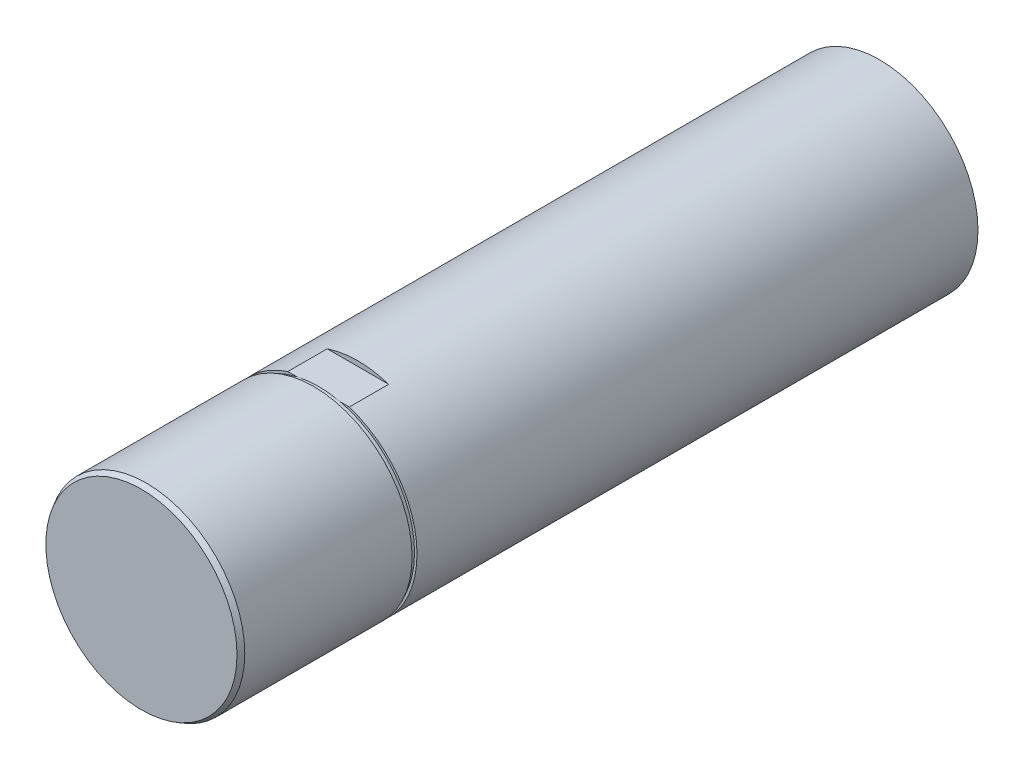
from build123d import *

# Parameters (mm, degrees)
SKETCH1_R        = 20
STROKE_DEPTH     = 100
EXTRUDE_START    = 14
SKETCH2_R        = 20
EXTRUDE_L2_DEPTH = 14
EXTRUDE_START_2  = 36
SKETCH3_R        = 20
EXTRUDE_L3_DEPTH = 36
CHAMFER2_SIZE    = 1
CHAMFER2_SIZE2   = 0.577350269
U_C_START        = 1
SKETCH5_R        = 20
SKETCH5_R_2      = 19.5
U_C_DEPTH        = 1
SKETCH6_W        = 8
SKETCH6_H        = 1.5
A_F_DEPTH        = 10.5


with BuildPart() as part:
    # Sketch1 → STROKE (new body)
    with BuildSketch(Plane.XY):
        Circle(SKETCH1_R)
    extrude(amount=-STROKE_DEPTH)

    # Sketch2 → Extrude L2 (add)
    with BuildSketch(Plane.XY.offset(EXTRUDE_START)):
        Circle(SKETCH2_R)
    extrude(amount=-EXTRUDE_L2_DEPTH)

    # Sketch3 → Extrude L3 (add)
    with BuildSketch(Plane.XY.offset(14).offset(EXTRUDE_START_2)):
        Circle(SKETCH3_R)
    extrude(amount=-EXTRUDE_L3_DEPTH)

    # Chamfer2
    chamfer2_edges = [part.edges().sort_by_distance(p)[0] for p in [
        (-20, 0, 50),
    ]]
    chamfer2_side = [part.faces().sort_by_distance(p)[0] for p in [
        (-20, 0, -25),
    ]]
    chamfer(chamfer2_edges, length=CHAMFER2_SIZE, length2=CHAMFER2_SIZE2, reference=chamfer2_side[0])

    # Sketch5 → U_C (cut)
    with BuildSketch(Plane.XY.offset(14).offset(U_C_START)):
        Circle(SKETCH5_R)
        Circle(SKETCH5_R_2, mode=Mode.SUBTRACT)
    extrude(amount=-U_C_DEPTH, mode=Mode.SUBTRACT)

    # Sketch6 → A_F (cut, symmetric)
    with BuildSketch(Plane(origin=(0, 0, 0), x_dir=(0, 0, -1), z_dir=(1, 0, 0))):
        with Locations((-10, 19.75)):
            Rectangle(SKETCH6_W, SKETCH6_H)
        with Locations((-10, -19.75)):
            Rectangle(SKETCH6_W, SKETCH6_H)
    extrude(amount=A_F_DEPTH, both=True, mode=Mode.SUBTRACT)


solid = part.part
